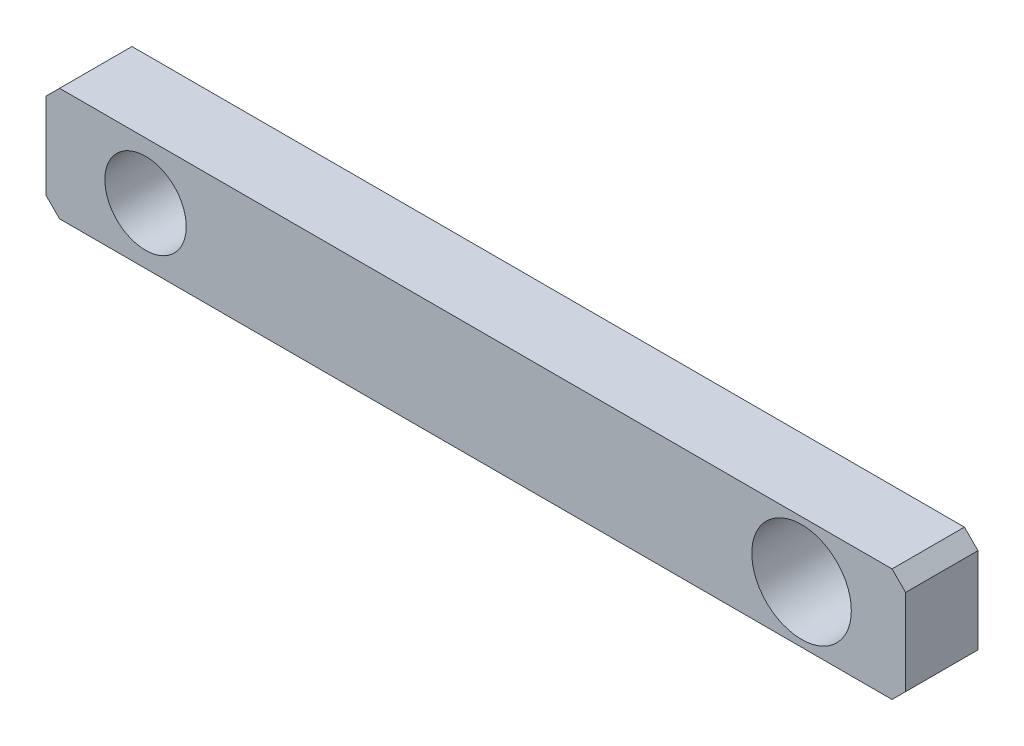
ISO-10303-21;
HEADER;
FILE_DESCRIPTION(('STEP AP214'),'2;1');
FILE_NAME('part.step','',(''),(''),'','','');
FILE_SCHEMA(('AUTOMOTIVE_DESIGN { 1 0 10303 214 1 1 1 1 }'));
ENDSEC;
DATA;
#1=APPLICATION_CONTEXT('core data for automotive mechanical design processes');
#2=APPLICATION_PROTOCOL_DEFINITION('international standard','automotive_design',2000,#1);
#3=PRODUCT_CONTEXT('',#1,'mechanical');
#4=PRODUCT('Part','Part','',(#3));
#5=PRODUCT_RELATED_PRODUCT_CATEGORY('part','',(#4));
#6=PRODUCT_DEFINITION_FORMATION('','',#4);
#7=PRODUCT_DEFINITION_CONTEXT('part definition',#1,'design');
#8=PRODUCT_DEFINITION('design','',#6,#7);
#9=PRODUCT_DEFINITION_SHAPE('','',#8);
#10=(LENGTH_UNIT() NAMED_UNIT(*) SI_UNIT(.MILLI.,.METRE.));
#11=(NAMED_UNIT(*) PLANE_ANGLE_UNIT() SI_UNIT($,.RADIAN.));
#12=(NAMED_UNIT(*) SI_UNIT($,.STERADIAN.) SOLID_ANGLE_UNIT());
#13=UNCERTAINTY_MEASURE_WITH_UNIT(LENGTH_MEASURE(1.E-05),#10,'distance_accuracy_value','');
#14=(GEOMETRIC_REPRESENTATION_CONTEXT(3) GLOBAL_UNCERTAINTY_ASSIGNED_CONTEXT((#13)) GLOBAL_UNIT_ASSIGNED_CONTEXT((#10,
#11,#12)) REPRESENTATION_CONTEXT('',''));
#15=CARTESIAN_POINT('',(0.,0.,0.));
#16=DIRECTION('',(0.,0.,1.));
#17=DIRECTION('',(1.,0.,0.));
#18=AXIS2_PLACEMENT_3D('',#15,#16,#17);
#19=CARTESIAN_POINT('',(-150.527977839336,3.1707756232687,16.));
#20=DIRECTION('',(1.,0.,0.));
#21=DIRECTION('',(0.,0.,-1.));
#22=AXIS2_PLACEMENT_3D('',#19,#20,#21);
#23=PLANE('',#22);
#24=DIRECTION('',(0.,-1.,0.));
#25=VECTOR('',#24,1.);
#26=CARTESIAN_POINT('',(-150.527977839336,3.1707756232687,16.));
#27=LINE('',#26,#25);
#28=CARTESIAN_POINT('',(-150.527977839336,0.170775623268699,16.));
#29=VERTEX_POINT('',#28);
#30=CARTESIAN_POINT('',(-150.527977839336,-18.8292243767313,16.));
#31=VERTEX_POINT('',#30);
#32=EDGE_CURVE('E131',#29,#31,#27,.T.);
#33=ORIENTED_EDGE('',*,*,#32,.F.);
#34=DIRECTION('',(0.,0.,-1.));
#35=VECTOR('',#34,1.);
#36=CARTESIAN_POINT('',(-150.527977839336,0.170775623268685,16.));
#37=LINE('',#36,#35);
#38=CARTESIAN_POINT('',(-150.527977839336,0.170775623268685,0.));
#39=VERTEX_POINT('',#38);
#40=EDGE_CURVE('E11',#29,#39,#37,.T.);
#41=ORIENTED_EDGE('',*,*,#40,.T.);
#42=DIRECTION('',(0.,-1.,0.));
#43=VECTOR('',#42,1.);
#44=CARTESIAN_POINT('',(-150.527977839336,3.17077562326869,0.));
#45=LINE('',#44,#43);
#46=CARTESIAN_POINT('',(-150.527977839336,-18.8292243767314,0.));
#47=VERTEX_POINT('',#46);
#48=EDGE_CURVE('E165',#39,#47,#45,.T.);
#49=ORIENTED_EDGE('',*,*,#48,.T.);
#50=DIRECTION('',(0.,0.,1.));
#51=VECTOR('',#50,1.);
#52=CARTESIAN_POINT('',(-150.527977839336,-18.8292243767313,16.));
#53=LINE('',#52,#51);
#54=EDGE_CURVE('E44',#47,#31,#53,.T.);
#55=ORIENTED_EDGE('',*,*,#54,.T.);
#56=EDGE_LOOP('',(#33,#41,#49,#55));
#57=FACE_BOUND('',#56,.T.);
#58=ADVANCED_FACE('F36',(#57),#23,.F.);
#59=CARTESIAN_POINT('',(-150.527977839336,-21.8292243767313,16.));
#60=DIRECTION('',(0.,1.,0.));
#61=DIRECTION('',(0.,0.,1.));
#62=AXIS2_PLACEMENT_3D('',#59,#60,#61);
#63=PLANE('',#62);
#64=DIRECTION('',(1.,0.,0.));
#65=VECTOR('',#64,1.);
#66=CARTESIAN_POINT('',(-150.527977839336,-21.8292243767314,0.));
#67=LINE('',#66,#65);
#68=CARTESIAN_POINT('',(-147.527977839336,-21.8292243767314,0.));
#69=VERTEX_POINT('',#68);
#70=CARTESIAN_POINT('',(36.4720221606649,-21.8292243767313,-1.38777878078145E-13));
#71=VERTEX_POINT('',#70);
#72=EDGE_CURVE('E136',#69,#71,#67,.T.);
#73=ORIENTED_EDGE('',*,*,#72,.T.);
#74=DIRECTION('',(0.,0.,1.));
#75=VECTOR('',#74,1.);
#76=CARTESIAN_POINT('',(36.4720221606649,-21.8292243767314,16.));
#77=LINE('',#76,#75);
#78=CARTESIAN_POINT('',(36.4720221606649,-21.8292243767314,16.));
#79=VERTEX_POINT('',#78);
#80=EDGE_CURVE('E52',#71,#79,#77,.T.);
#81=ORIENTED_EDGE('',*,*,#80,.T.);
#82=DIRECTION('',(1.,0.,0.));
#83=VECTOR('',#82,1.);
#84=CARTESIAN_POINT('',(-150.527977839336,-21.8292243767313,16.));
#85=LINE('',#84,#83);
#86=CARTESIAN_POINT('',(-147.527977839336,-21.8292243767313,16.));
#87=VERTEX_POINT('',#86);
#88=EDGE_CURVE('E134',#87,#79,#85,.T.);
#89=ORIENTED_EDGE('',*,*,#88,.F.);
#90=DIRECTION('',(0.,0.,-1.));
#91=VECTOR('',#90,1.);
#92=CARTESIAN_POINT('',(-147.527977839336,-21.8292243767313,16.));
#93=LINE('',#92,#91);
#94=EDGE_CURVE('E159',#87,#69,#93,.T.);
#95=ORIENTED_EDGE('',*,*,#94,.T.);
#96=EDGE_LOOP('',(#73,#81,#89,#95));
#97=FACE_BOUND('',#96,.T.);
#98=ADVANCED_FACE('F179',(#97),#63,.F.);
#99=CARTESIAN_POINT('',(39.4720221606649,3.17077562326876,16.));
#100=DIRECTION('',(-1.,0.,0.));
#101=DIRECTION('',(0.,-1.,0.));
#102=AXIS2_PLACEMENT_3D('',#99,#100,#101);
#103=PLANE('',#102);
#104=DIRECTION('',(0.,1.,0.));
#105=VECTOR('',#104,1.);
#106=CARTESIAN_POINT('',(39.4720221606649,3.1707756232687,0.));
#107=LINE('',#106,#105);
#108=CARTESIAN_POINT('',(39.4720221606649,-18.8292243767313,0.));
#109=VERTEX_POINT('',#108);
#110=CARTESIAN_POINT('',(39.4720221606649,0.170775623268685,0.));
#111=VERTEX_POINT('',#110);
#112=EDGE_CURVE('E132',#109,#111,#107,.T.);
#113=ORIENTED_EDGE('',*,*,#112,.T.);
#114=DIRECTION('',(0.,0.,1.));
#115=VECTOR('',#114,1.);
#116=CARTESIAN_POINT('',(39.4720221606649,0.170775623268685,16.));
#117=LINE('',#116,#115);
#118=CARTESIAN_POINT('',(39.4720221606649,0.170775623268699,16.));
#119=VERTEX_POINT('',#118);
#120=EDGE_CURVE('E109',#111,#119,#117,.T.);
#121=ORIENTED_EDGE('',*,*,#120,.T.);
#122=DIRECTION('',(0.,1.,0.));
#123=VECTOR('',#122,1.);
#124=CARTESIAN_POINT('',(39.4720221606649,3.17077562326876,16.));
#125=LINE('',#124,#123);
#126=CARTESIAN_POINT('',(39.4720221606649,-18.8292243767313,16.));
#127=VERTEX_POINT('',#126);
#128=EDGE_CURVE('E141',#127,#119,#125,.T.);
#129=ORIENTED_EDGE('',*,*,#128,.F.);
#130=DIRECTION('',(0.,0.,-1.));
#131=VECTOR('',#130,1.);
#132=CARTESIAN_POINT('',(39.4720221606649,-18.8292243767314,16.));
#133=LINE('',#132,#131);
#134=EDGE_CURVE('E114',#127,#109,#133,.T.);
#135=ORIENTED_EDGE('',*,*,#134,.T.);
#136=EDGE_LOOP('',(#113,#121,#129,#135));
#137=FACE_BOUND('',#136,.T.);
#138=ADVANCED_FACE('F188',(#137),#103,.F.);
#139=CARTESIAN_POINT('',(-150.527977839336,3.1707756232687,16.));
#140=DIRECTION('',(0.,-1.,0.));
#141=DIRECTION('',(0.,0.,-1.));
#142=AXIS2_PLACEMENT_3D('',#139,#140,#141);
#143=PLANE('',#142);
#144=DIRECTION('',(-1.,0.,0.));
#145=VECTOR('',#144,1.);
#146=CARTESIAN_POINT('',(-150.527977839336,3.1707756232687,16.));
#147=LINE('',#146,#145);
#148=CARTESIAN_POINT('',(36.4720221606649,3.17077562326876,16.));
#149=VERTEX_POINT('',#148);
#150=CARTESIAN_POINT('',(-147.527977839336,3.1707756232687,16.));
#151=VERTEX_POINT('',#150);
#152=EDGE_CURVE('E124',#149,#151,#147,.T.);
#153=ORIENTED_EDGE('',*,*,#152,.F.);
#154=DIRECTION('',(0.,0.,-1.));
#155=VECTOR('',#154,1.);
#156=CARTESIAN_POINT('',(36.4720221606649,3.17077562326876,16.));
#157=LINE('',#156,#155);
#158=CARTESIAN_POINT('',(36.4720221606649,3.17077562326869,0.));
#159=VERTEX_POINT('',#158);
#160=EDGE_CURVE('E108',#149,#159,#157,.T.);
#161=ORIENTED_EDGE('',*,*,#160,.T.);
#162=DIRECTION('',(-1.,0.,0.));
#163=VECTOR('',#162,1.);
#164=CARTESIAN_POINT('',(-150.527977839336,3.17077562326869,0.));
#165=LINE('',#164,#163);
#166=CARTESIAN_POINT('',(-147.527977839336,3.17077562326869,0.));
#167=VERTEX_POINT('',#166);
#168=EDGE_CURVE('E121',#159,#167,#165,.T.);
#169=ORIENTED_EDGE('',*,*,#168,.T.);
#170=DIRECTION('',(0.,0.,1.));
#171=VECTOR('',#170,1.);
#172=CARTESIAN_POINT('',(-147.527977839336,3.1707756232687,16.));
#173=LINE('',#172,#171);
#174=EDGE_CURVE('E126',#167,#151,#173,.T.);
#175=ORIENTED_EDGE('',*,*,#174,.T.);
#176=EDGE_LOOP('',(#153,#161,#169,#175));
#177=FACE_BOUND('',#176,.T.);
#178=ADVANCED_FACE('F120',(#177),#143,.F.);
#179=CARTESIAN_POINT('',(-150.527977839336,-21.8292243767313,16.));
#180=DIRECTION('',(0.,0.,1.));
#181=DIRECTION('',(1.,0.,0.));
#182=AXIS2_PLACEMENT_3D('',#179,#180,#181);
#183=PLANE('',#182);
#184=CARTESIAN_POINT('',(16.4720221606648,-9.32922437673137,16.));
#185=DIRECTION('',(0.,0.,1.));
#186=DIRECTION('',(1.,0.,0.));
#187=AXIS2_PLACEMENT_3D('',#184,#185,#186);
#188=CIRCLE('',#187,11.);
#189=CARTESIAN_POINT('',(27.4720221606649,-9.32922437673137,16.));
#190=VERTEX_POINT('',#189);
#191=EDGE_CURVE('E176',#190,#190,#188,.T.);
#192=ORIENTED_EDGE('',*,*,#191,.F.);
#193=EDGE_LOOP('',(#192));
#194=FACE_BOUND('',#193,.T.);
#195=CARTESIAN_POINT('',(-128.527977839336,-9.32922437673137,16.));
#196=DIRECTION('',(0.,0.,1.));
#197=DIRECTION('',(1.,0.,0.));
#198=AXIS2_PLACEMENT_3D('',#195,#196,#197);
#199=CIRCLE('',#198,9.);
#200=CARTESIAN_POINT('',(-119.527977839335,-9.32922437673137,16.));
#201=VERTEX_POINT('',#200);
#202=EDGE_CURVE('E166',#201,#201,#199,.T.);
#203=ORIENTED_EDGE('',*,*,#202,.F.);
#204=EDGE_LOOP('',(#203));
#205=FACE_BOUND('',#204,.T.);
#206=ORIENTED_EDGE('',*,*,#128,.T.);
#207=DIRECTION('',(0.707106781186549,-0.707106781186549,0.));
#208=VECTOR('',#207,1.);
#209=CARTESIAN_POINT('',(-44.5279778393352,84.1707756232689,16.));
#210=LINE('',#209,#208);
#211=EDGE_CURVE('E157',#119,#149,#210,.F.);
#212=ORIENTED_EDGE('',*,*,#211,.T.);
#213=ORIENTED_EDGE('',*,*,#152,.T.);
#214=DIRECTION('',(0.707106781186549,0.707106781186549,0.));
#215=VECTOR('',#214,1.);
#216=CARTESIAN_POINT('',(-161.527977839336,-10.8292243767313,16.));
#217=LINE('',#216,#215);
#218=EDGE_CURVE('E153',#151,#29,#217,.F.);
#219=ORIENTED_EDGE('',*,*,#218,.T.);
#220=ORIENTED_EDGE('',*,*,#32,.T.);
#221=DIRECTION('',(-0.70710678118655,0.707106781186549,0.));
#222=VECTOR('',#221,1.);
#223=CARTESIAN_POINT('',(-149.027977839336,-20.3292243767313,16.));
#224=LINE('',#223,#222);
#225=EDGE_CURVE('E59',#31,#87,#224,.F.);
#226=ORIENTED_EDGE('',*,*,#225,.T.);
#227=ORIENTED_EDGE('',*,*,#88,.T.);
#228=DIRECTION('',(-0.707106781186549,-0.707106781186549,0.));
#229=VECTOR('',#228,1.);
#230=CARTESIAN_POINT('',(-57.0279778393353,-115.329224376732,16.));
#231=LINE('',#230,#229);
#232=EDGE_CURVE('E155',#79,#127,#231,.F.);
#233=ORIENTED_EDGE('',*,*,#232,.T.);
#234=EDGE_LOOP('',(#206,#212,#213,#219,#220,#226,#227,#233));
#235=FACE_BOUND('',#234,.T.);
#236=ADVANCED_FACE('F186',(#194,#205,#235),#183,.T.);
#237=CARTESIAN_POINT('',(-150.527977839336,-21.8292243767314,0.));
#238=DIRECTION('',(0.,0.,1.));
#239=DIRECTION('',(1.,0.,0.));
#240=AXIS2_PLACEMENT_3D('',#237,#238,#239);
#241=PLANE('',#240);
#242=CARTESIAN_POINT('',(16.4720221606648,-9.32922437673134,0.));
#243=DIRECTION('',(0.,0.,1.));
#244=DIRECTION('',(1.,0.,0.));
#245=AXIS2_PLACEMENT_3D('',#242,#243,#244);
#246=CIRCLE('',#245,11.);
#247=CARTESIAN_POINT('',(27.4720221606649,-9.32922437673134,0.));
#248=VERTEX_POINT('',#247);
#249=EDGE_CURVE('E39',#248,#248,#246,.T.);
#250=ORIENTED_EDGE('',*,*,#249,.T.);
#251=EDGE_LOOP('',(#250));
#252=FACE_BOUND('',#251,.T.);
#253=CARTESIAN_POINT('',(-128.527977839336,-9.32922437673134,0.));
#254=DIRECTION('',(0.,0.,1.));
#255=DIRECTION('',(1.,0.,0.));
#256=AXIS2_PLACEMENT_3D('',#253,#254,#255);
#257=CIRCLE('',#256,9.);
#258=CARTESIAN_POINT('',(-119.527977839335,-9.32922437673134,0.));
#259=VERTEX_POINT('',#258);
#260=EDGE_CURVE('E163',#259,#259,#257,.T.);
#261=ORIENTED_EDGE('',*,*,#260,.T.);
#262=EDGE_LOOP('',(#261));
#263=FACE_BOUND('',#262,.T.);
#264=ORIENTED_EDGE('',*,*,#168,.F.);
#265=DIRECTION('',(-0.707106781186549,0.707106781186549,0.));
#266=VECTOR('',#265,1.);
#267=CARTESIAN_POINT('',(36.4720221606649,3.1707756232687,0.));
#268=LINE('',#267,#266);
#269=EDGE_CURVE('E104',#159,#111,#268,.F.);
#270=ORIENTED_EDGE('',*,*,#269,.T.);
#271=ORIENTED_EDGE('',*,*,#112,.F.);
#272=DIRECTION('',(0.707106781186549,0.707106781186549,0.));
#273=VECTOR('',#272,1.);
#274=CARTESIAN_POINT('',(39.4720221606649,-18.8292243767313,0.));
#275=LINE('',#274,#273);
#276=EDGE_CURVE('E115',#109,#71,#275,.F.);
#277=ORIENTED_EDGE('',*,*,#276,.T.);
#278=ORIENTED_EDGE('',*,*,#72,.F.);
#279=DIRECTION('',(0.70710678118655,-0.707106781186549,0.));
#280=VECTOR('',#279,1.);
#281=CARTESIAN_POINT('',(-147.527977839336,-21.8292243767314,0.));
#282=LINE('',#281,#280);
#283=EDGE_CURVE('E125',#69,#47,#282,.F.);
#284=ORIENTED_EDGE('',*,*,#283,.T.);
#285=ORIENTED_EDGE('',*,*,#48,.F.);
#286=DIRECTION('',(-0.707106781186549,-0.707106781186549,0.));
#287=VECTOR('',#286,1.);
#288=CARTESIAN_POINT('',(-150.527977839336,0.170775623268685,0.));
#289=LINE('',#288,#287);
#290=EDGE_CURVE('E130',#39,#167,#289,.F.);
#291=ORIENTED_EDGE('',*,*,#290,.T.);
#292=EDGE_LOOP('',(#264,#270,#271,#277,#278,#284,#285,#291));
#293=FACE_BOUND('',#292,.T.);
#294=ADVANCED_FACE('F128',(#252,#263,#293),#241,.F.);
#295=CARTESIAN_POINT('',(36.4720221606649,3.17077562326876,16.));
#296=DIRECTION('',(-0.707106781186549,-0.707106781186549,0.));
#297=DIRECTION('',(0.707106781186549,-0.707106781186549,0.));
#298=AXIS2_PLACEMENT_3D('',#295,#296,#297);
#299=PLANE('',#298);
#300=ORIENTED_EDGE('',*,*,#211,.F.);
#301=ORIENTED_EDGE('',*,*,#120,.F.);
#302=ORIENTED_EDGE('',*,*,#269,.F.);
#303=ORIENTED_EDGE('',*,*,#160,.F.);
#304=EDGE_LOOP('',(#300,#301,#302,#303));
#305=FACE_BOUND('',#304,.T.);
#306=ADVANCED_FACE('F107',(#305),#299,.F.);
#307=CARTESIAN_POINT('',(39.4720221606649,-18.8292243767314,16.));
#308=DIRECTION('',(-0.707106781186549,0.707106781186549,0.));
#309=DIRECTION('',(-0.707106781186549,-0.707106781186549,0.));
#310=AXIS2_PLACEMENT_3D('',#307,#308,#309);
#311=PLANE('',#310);
#312=ORIENTED_EDGE('',*,*,#232,.F.);
#313=ORIENTED_EDGE('',*,*,#80,.F.);
#314=ORIENTED_EDGE('',*,*,#276,.F.);
#315=ORIENTED_EDGE('',*,*,#134,.F.);
#316=EDGE_LOOP('',(#312,#313,#314,#315));
#317=FACE_BOUND('',#316,.T.);
#318=ADVANCED_FACE('F183',(#317),#311,.F.);
#319=CARTESIAN_POINT('',(-150.527977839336,0.170775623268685,16.));
#320=DIRECTION('',(0.707106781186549,-0.707106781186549,0.));
#321=DIRECTION('',(0.707106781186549,0.707106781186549,0.));
#322=AXIS2_PLACEMENT_3D('',#319,#320,#321);
#323=PLANE('',#322);
#324=ORIENTED_EDGE('',*,*,#218,.F.);
#325=ORIENTED_EDGE('',*,*,#174,.F.);
#326=ORIENTED_EDGE('',*,*,#290,.F.);
#327=ORIENTED_EDGE('',*,*,#40,.F.);
#328=EDGE_LOOP('',(#324,#325,#326,#327));
#329=FACE_BOUND('',#328,.T.);
#330=ADVANCED_FACE('F203',(#329),#323,.F.);
#331=CARTESIAN_POINT('',(-147.527977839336,-21.8292243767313,16.));
#332=DIRECTION('',(0.707106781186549,0.70710678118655,0.));
#333=DIRECTION('',(-0.70710678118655,0.707106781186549,0.));
#334=AXIS2_PLACEMENT_3D('',#331,#332,#333);
#335=PLANE('',#334);
#336=ORIENTED_EDGE('',*,*,#225,.F.);
#337=ORIENTED_EDGE('',*,*,#54,.F.);
#338=ORIENTED_EDGE('',*,*,#283,.F.);
#339=ORIENTED_EDGE('',*,*,#94,.F.);
#340=EDGE_LOOP('',(#336,#337,#338,#339));
#341=FACE_BOUND('',#340,.T.);
#342=ADVANCED_FACE('F205',(#341),#335,.F.);
#343=CARTESIAN_POINT('',(-128.527977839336,-9.32922437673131,-14.));
#344=DIRECTION('',(0.,0.,1.));
#345=DIRECTION('',(1.,0.,0.));
#346=AXIS2_PLACEMENT_3D('',#343,#344,#345);
#347=CYLINDRICAL_SURFACE('',#346,9.);
#348=ORIENTED_EDGE('',*,*,#202,.T.);
#349=EDGE_LOOP('',(#348));
#350=FACE_BOUND('',#349,.T.);
#351=ORIENTED_EDGE('',*,*,#260,.F.);
#352=EDGE_LOOP('',(#351));
#353=FACE_BOUND('',#352,.T.);
#354=ADVANCED_FACE('F210',(#350,#353),#347,.F.);
#355=CARTESIAN_POINT('',(16.4720221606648,-9.32922437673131,-14.));
#356=DIRECTION('',(0.,0.,1.));
#357=DIRECTION('',(1.,0.,0.));
#358=AXIS2_PLACEMENT_3D('',#355,#356,#357);
#359=CYLINDRICAL_SURFACE('',#358,11.);
#360=ORIENTED_EDGE('',*,*,#191,.T.);
#361=EDGE_LOOP('',(#360));
#362=FACE_BOUND('',#361,.T.);
#363=ORIENTED_EDGE('',*,*,#249,.F.);
#364=EDGE_LOOP('',(#363));
#365=FACE_BOUND('',#364,.T.);
#366=ADVANCED_FACE('F228',(#362,#365),#359,.F.);
#367=CLOSED_SHELL('',(#58,#98,#138,#178,#236,#294,#306,#318,#330,#342,#354,#366));
#368=MANIFOLD_SOLID_BREP('B2',#367);
#369=ADVANCED_BREP_SHAPE_REPRESENTATION('',(#18,#368),#14);
#370=SHAPE_DEFINITION_REPRESENTATION(#9,#369);
ENDSEC;
END-ISO-10303-21;
